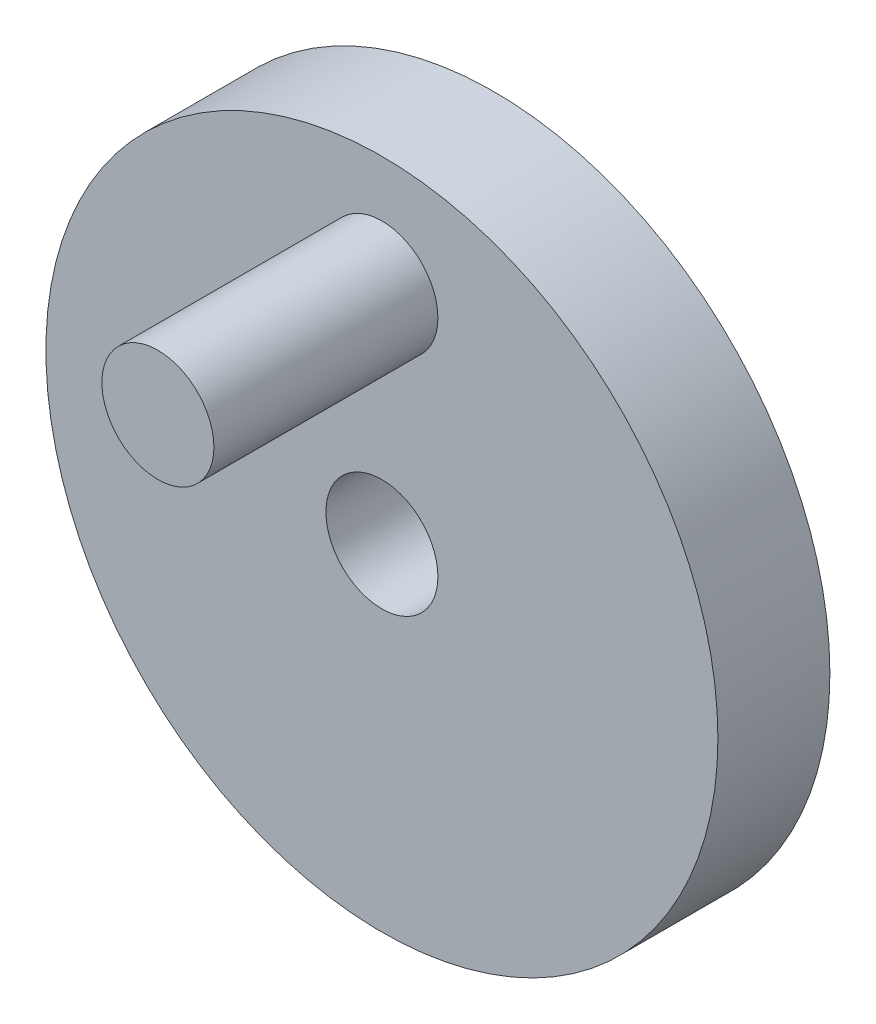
from build123d import *

# Parameters (mm, degrees)
SKETCH1_R           = 30
BOSS_EXTRUDE1_DEPTH = 10
SKETCH2_R           = 5
CUT_EXTRUDE1_DEPTH  = 10
SKETCH3_R           = 5
BOSS_EXTRUDE2_DEPTH = 20


with BuildPart() as part:
    # Sketch1 → Boss-Extrude1 (new body)
    with BuildSketch(Plane.XY):
        Circle(SKETCH1_R)
    extrude(amount=BOSS_EXTRUDE1_DEPTH)

    # Sketch2 → Cut-Extrude1 (cut)
    with BuildSketch(Plane.XY.offset(10)):
        Circle(SKETCH2_R)
    extrude(amount=-CUT_EXTRUDE1_DEPTH, mode=Mode.SUBTRACT)

    # Sketch3 → Boss-Extrude2 (add)
    with BuildSketch(Plane.XY.offset(10)):
        with Locations((0, 20)):
            Circle(SKETCH3_R)
    extrude(amount=BOSS_EXTRUDE2_DEPTH)


solid = part.part
